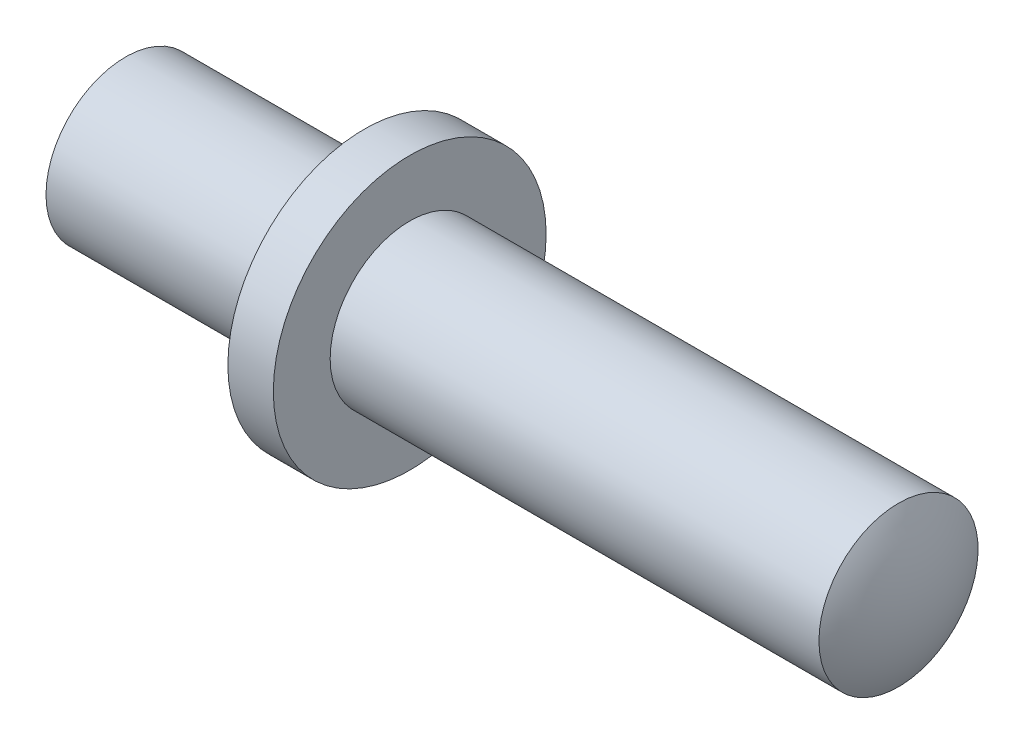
from build123d import *


with BuildPart() as part:
    # Esquisse1 → R_volution1 (revolve)
    with BuildSketch(Plane.XY, mode=Mode.PRIVATE) as r_volution1_sk:
        with BuildLine():
            Line((10.056062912, 0), (10.056062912, 7))
            Line((10.056062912, 7), (31.056062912, 7))
            Line((31.056062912, 7), (31.056062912, 12))
            Line((31.056062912, 12), (35.056062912, 12))
            Line((35.056062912, 12), (35.056062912, 7))
            Line((35.056062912, 7), (78.056062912, 7))
            ThreePointArc((78.056062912, 7), (79.533389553, 3.637662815), (80.038577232, 0))
            Line((80.038577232, 0), (10.056062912, 0))
        make_face()
    revolve(r_volution1_sk.sketch.rotate(Axis((0, 0, 0), (1, 0, 0)), 90), axis=Axis((0, 0, 0), (1, 0, 0)))


solid = part.part
